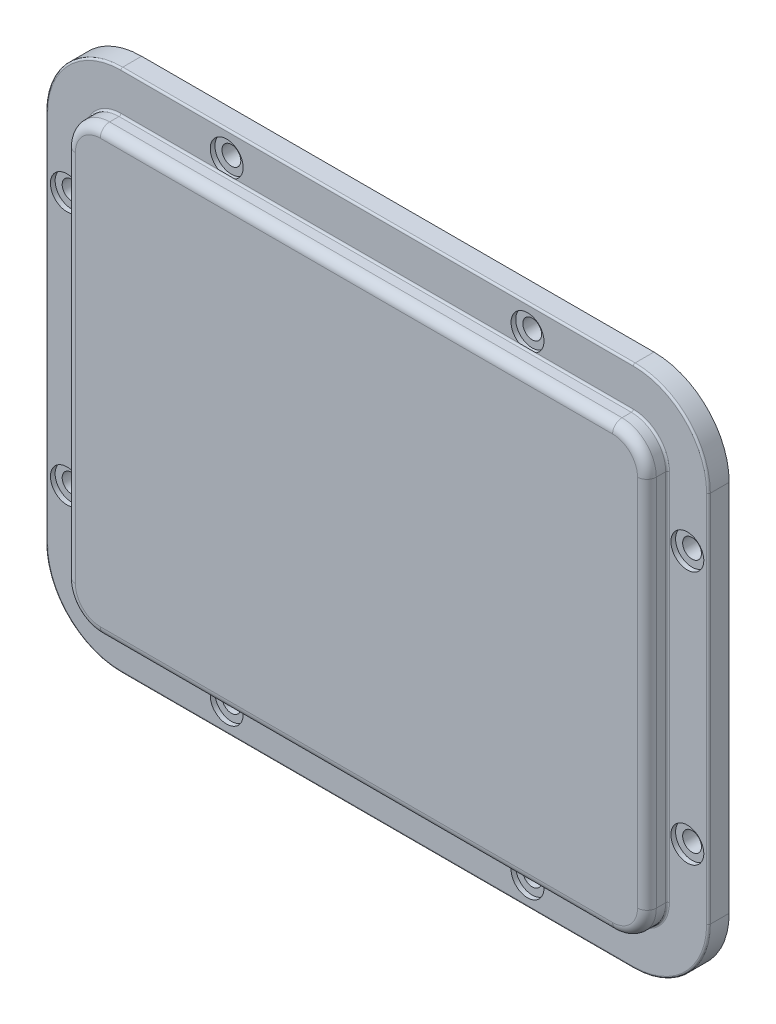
from build123d import *

# Parameters (mm, degrees)
EXTRUSION1_DEPTH        = 6.6
ESQUISSE2_OUTSIDE_W     = 46.332
ESQUISSE2_OUTSIDE_H     = 38.932
ENL_V_MAT_EXTRU_1_DEPTH = 2.2
CONG_2_R                = 0.2
CONG_3_R                = 1
ESQUISSE3_OUTSIDE_W     = 46.332
ESQUISSE3_OUTSIDE_H     = 38.932
ENL_V_MAT_EXTRU_2_DEPTH = 2.2
ENL_V_MAT_EXTRU_3_DEPTH = 5
CONG_4_R                = 0.5
ENL_V_MAT_EXTRU_4_REACH = 47.139
ESQUISSE5_R             = 1
ESQUISSE6_R             = 1.75
ENL_V_MAT_EXTRU_5_DEPTH = 0.5


with BuildPart() as part:
    # Esquisse1 → Extrusion1 (new body)
    with BuildSketch(Plane.XY):
        with BuildLine():
            Line((-35.25, 0), (0, 0))
            Line((0, 0), (0, 27.85))
            Line((0, 27.85), (-27.25, 27.85))
            ThreePointArc((-27.25, 27.85), (-32.906854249, 25.506854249), (-35.25, 19.85))
            Line((-35.25, 19.85), (-35.25, 0))
        make_face()
    extrude(amount=EXTRUSION1_DEPTH)

    # Esquisse2 outside → Enl_v. mat.-Extru.1 (cut)
    with BuildSketch(Plane.XY.offset(6.6)):
        with Locations((-17.625, 13.925)):
            Rectangle(ESQUISSE2_OUTSIDE_W, ESQUISSE2_OUTSIDE_H)
        with BuildLine():
            Line((0, 0), (-30.9, 0))
            Line((-30.9, 0), (-30.9, 19.85))
            ThreePointArc((-30.9, 19.85), (-29.830939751, 22.430939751), (-27.25, 23.5))
            Line((-27.25, 23.5), (0, 23.5))
            Line((0, 23.5), (0, 0))
        make_face(mode=Mode.SUBTRACT)
    extrude(amount=-ENL_V_MAT_EXTRU_1_DEPTH, mode=Mode.SUBTRACT)

    # Cong_2
    cong_2_edges = [part.edges().sort_by_distance(p)[0] for p in [
        (-32.906854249, 25.506854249, 4.4),
        (-13.625, 23.5, 4.4),
        (-29.830939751, 22.430939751, 4.4),
        (-30.9, 9.925, 4.4),
        (-35.25, 9.925, 4.4),
        (-13.625, 27.85, 4.4),
    ]]
    fillet(cong_2_edges, radius=CONG_2_R)

    # Cong_3
    cong_3_edges = [part.edges().sort_by_distance(p)[0] for p in [
        (-30.9, 9.925, 6.6),
        (-29.830939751, 22.430939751, 6.6),
        (-13.625, 23.5, 6.6),
    ]]
    fillet(cong_3_edges, radius=CONG_3_R)

    # Esquisse3 outside → Enl_v. mat.-Extru.2 (cut)
    with BuildSketch(Plane(origin=(0, 0, 0), x_dir=(-1, 0, 0), z_dir=(0, 0, -1))):
        with Locations((17.625, 13.925)):
            Rectangle(ESQUISSE3_OUTSIDE_W, ESQUISSE3_OUTSIDE_H)
        with BuildLine():
            Line((0, 0), (29.9, 0))
            Line((29.9, 0), (29.9, 20.6))
            ThreePointArc((29.9, 20.6), (29.314213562, 22.014213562), (27.9, 22.6))
            Line((27.9, 22.6), (0, 22.6))
            Line((0, 22.6), (0, 0))
        make_face(mode=Mode.SUBTRACT)
    extrude(amount=-ENL_V_MAT_EXTRU_2_DEPTH, mode=Mode.SUBTRACT)

    # Esquisse4 → Enl_v. mat.-Extru.3 (cut)
    with BuildSketch(Plane(origin=(0, 0, 0), x_dir=(-1, 0, 0), z_dir=(0, 0, -1))):
        with BuildLine():
            Line((-0.037534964, 0), (28.7, 0))
            Line((28.7, 0), (28.7, 20.6))
            ThreePointArc((28.7, 20.6), (28.465685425, 21.165685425), (27.9, 21.4))
            Line((27.9, 21.4), (-0.037534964, 21.4))
            Line((-0.037534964, 21.4), (-0.037534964, 0))
        make_face()
    extrude(amount=-ENL_V_MAT_EXTRU_3_DEPTH, mode=Mode.SUBTRACT)

    # Cong_4
    cong_4_edges = [part.edges().sort_by_distance(p)[0] for p in [
        (-13.95, 21.4, 5),
        (-28.465685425, 21.165685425, 5),
        (-28.7, 10.3, 5),
    ]]
    fillet(cong_4_edges, radius=CONG_4_R)

    # Esquisse5 → Enl_v. mat.-Extru.4 (cut, up to next)
    with BuildSketch(Plane.XY.offset(4.4), mode=Mode.PRIVATE) as enl_v_mat_extru_4_sk1:
        with Locations((-16, 25.2)):
            Circle(ESQUISSE5_R)
    enl_v_mat_extru_4_tool1 = extrude(enl_v_mat_extru_4_sk1.sketch, amount=-ENL_V_MAT_EXTRU_4_REACH, mode=Mode.PRIVATE) & part.part
    # Esquisse5 → Enl_v. mat.-Extru.4 (cut, up to next)
    with BuildSketch(Plane.XY.offset(4.4), mode=Mode.PRIVATE) as enl_v_mat_extru_4_sk2:
        with Locations((-33, 13.5)):
            Circle(ESQUISSE5_R)
    enl_v_mat_extru_4_tool2 = extrude(enl_v_mat_extru_4_sk2.sketch, amount=-ENL_V_MAT_EXTRU_4_REACH, mode=Mode.PRIVATE) & part.part
    add(enl_v_mat_extru_4_tool1.solids().sort_by_distance((-16, 25.2, 4.4))[0], mode=Mode.SUBTRACT)
    add(enl_v_mat_extru_4_tool2.solids().sort_by_distance((-33, 13.5, 4.4))[0], mode=Mode.SUBTRACT)

    # Esquisse6 → Enl_v. mat.-Extru.5 (cut)
    with BuildSketch(Plane.XY.offset(4.4)):
        with Locations((-16, 25.2)):
            Circle(ESQUISSE6_R)
        with Locations((-33, 13.5)):
            Circle(ESQUISSE6_R)
    extrude(amount=-ENL_V_MAT_EXTRU_5_DEPTH, mode=Mode.SUBTRACT)

    # Sym_trie8: part across plane


with BuildPart() as part_1:
    add(part.part)
    add(part.part.mirror(Plane(origin=(0, 0, 6.6), x_dir=(0, 0, 1), z_dir=(-1, 0, 0))))

    # Sym_trie9: part across plane


with BuildPart() as part_2:
    add(part_1.part)
    add(part_1.part.mirror(Plane(origin=(-35.25, 0, 6.6), x_dir=(0, 0, 1), z_dir=(0, 1, 0))))


solid = part_2.part
